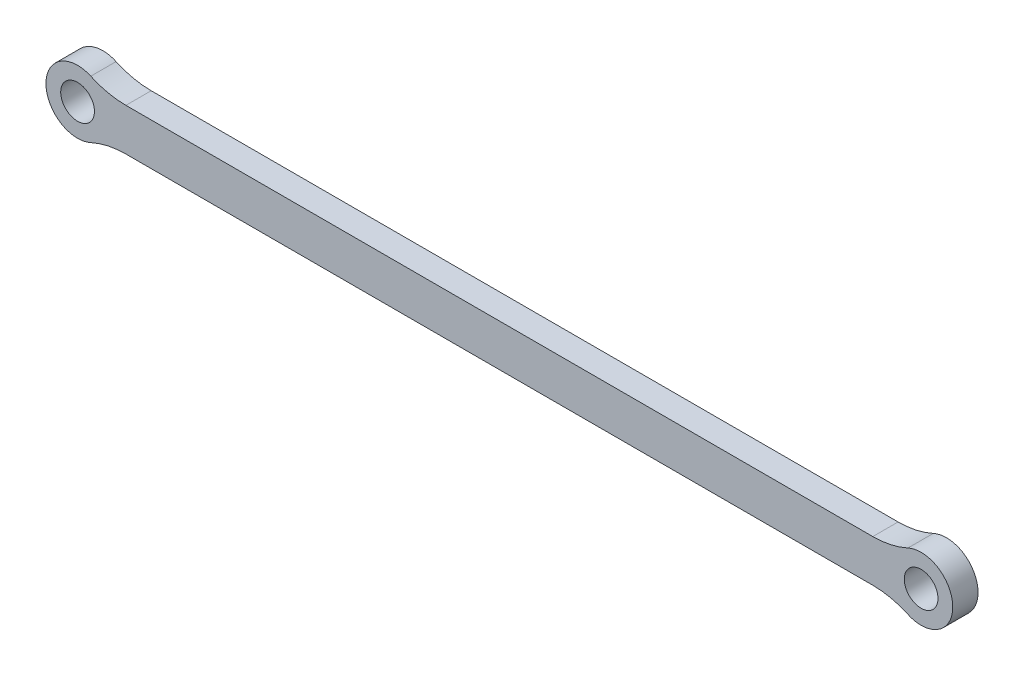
from build123d import *

# Parameters (mm, degrees)
CROQUIS1_R              = 4
SALIENTE_EXTRUIR1_DEPTH = 3


with BuildPart() as part:
    # Croquis1 → Saliente-Extruir1 (new, symmetric)
    with BuildSketch(Plane.XY):
        with BuildLine():
            Line((-88.543560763, 5), (88.543560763, 5))
            ThreePointArc((88.543560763, 5), (92.80757509, 5.459831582), (96.875516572, 6.818181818))
            ThreePointArc((96.875516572, 6.818181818), (107.5, 0), (96.875516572, -6.818181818))
            ThreePointArc((96.875516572, -6.818181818), (92.80757509, -5.459831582), (88.543560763, -5))
            Line((88.543560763, -5), (-88.543560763, -5))
            ThreePointArc((-88.543560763, -5), (-92.80757509, -5.459831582), (-96.875516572, -6.818181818))
            ThreePointArc((-96.875516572, -6.818181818), (-107.5, 0), (-96.875516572, 6.818181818))
            ThreePointArc((-96.875516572, 6.818181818), (-92.80757509, 5.459831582), (-88.543560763, 5))
        make_face()
        with Locations((-100, 0)):
            Circle(CROQUIS1_R, mode=Mode.SUBTRACT)
        with Locations((100, 0)):
            Circle(CROQUIS1_R, mode=Mode.SUBTRACT)
    extrude(amount=SALIENTE_EXTRUIR1_DEPTH, both=True)


solid = part.part
